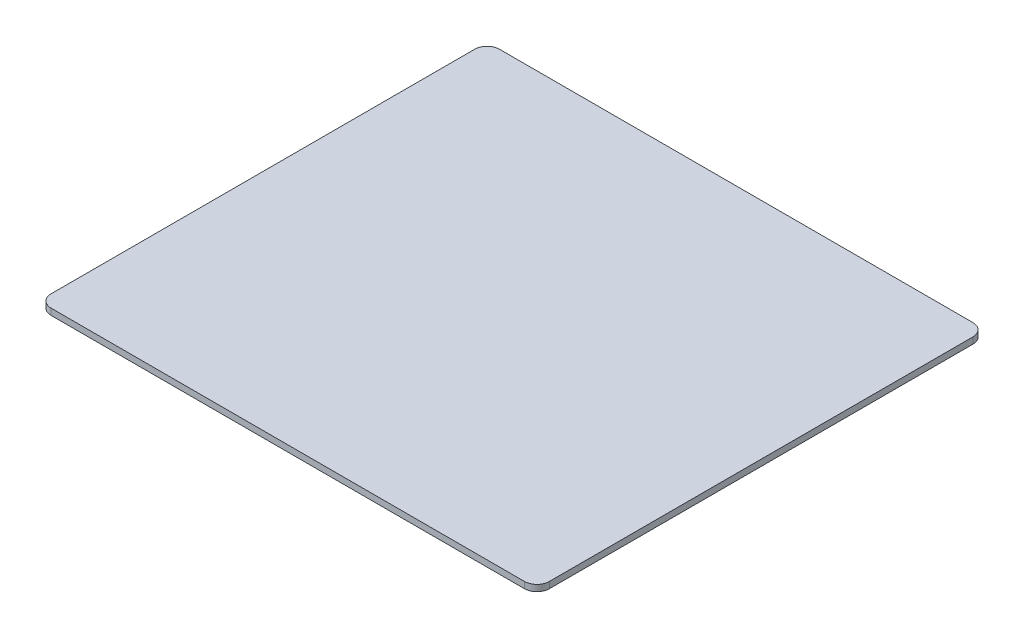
ISO-10303-21;
HEADER;
FILE_DESCRIPTION(('STEP AP214'),'2;1');
FILE_NAME('part.step','',(''),(''),'','','');
FILE_SCHEMA(('AUTOMOTIVE_DESIGN { 1 0 10303 214 1 1 1 1 }'));
ENDSEC;
DATA;
#1=APPLICATION_CONTEXT('core data for automotive mechanical design processes');
#2=APPLICATION_PROTOCOL_DEFINITION('international standard','automotive_design',2000,#1);
#3=PRODUCT_CONTEXT('',#1,'mechanical');
#4=PRODUCT('Part','Part','',(#3));
#5=PRODUCT_RELATED_PRODUCT_CATEGORY('part','',(#4));
#6=PRODUCT_DEFINITION_FORMATION('','',#4);
#7=PRODUCT_DEFINITION_CONTEXT('part definition',#1,'design');
#8=PRODUCT_DEFINITION('design','',#6,#7);
#9=PRODUCT_DEFINITION_SHAPE('','',#8);
#10=(LENGTH_UNIT() NAMED_UNIT(*) SI_UNIT(.MILLI.,.METRE.));
#11=(NAMED_UNIT(*) PLANE_ANGLE_UNIT() SI_UNIT($,.RADIAN.));
#12=(NAMED_UNIT(*) SI_UNIT($,.STERADIAN.) SOLID_ANGLE_UNIT());
#13=UNCERTAINTY_MEASURE_WITH_UNIT(LENGTH_MEASURE(1.E-05),#10,'distance_accuracy_value','');
#14=(GEOMETRIC_REPRESENTATION_CONTEXT(3) GLOBAL_UNCERTAINTY_ASSIGNED_CONTEXT((#13)) GLOBAL_UNIT_ASSIGNED_CONTEXT((#10,
#11,#12)) REPRESENTATION_CONTEXT('',''));
#15=CARTESIAN_POINT('',(0.,0.,0.));
#16=DIRECTION('',(0.,0.,1.));
#17=DIRECTION('',(1.,0.,0.));
#18=AXIS2_PLACEMENT_3D('',#15,#16,#17);
#19=CARTESIAN_POINT('',(-12.2260273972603,0.254,12.8630136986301));
#20=DIRECTION('',(1.,0.,0.));
#21=DIRECTION('',(0.,0.,-1.));
#22=AXIS2_PLACEMENT_3D('',#19,#20,#21);
#23=PLANE('',#22);
#24=DIRECTION('',(0.,0.,1.));
#25=VECTOR('',#24,1.);
#26=CARTESIAN_POINT('',(-12.2260273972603,0.254,12.8630136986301));
#27=LINE('',#26,#25);
#28=CARTESIAN_POINT('',(-12.2260273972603,0.254,-4.63698630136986));
#29=VERTEX_POINT('',#28);
#30=CARTESIAN_POINT('',(-12.2260273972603,0.254,12.3630136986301));
#31=VERTEX_POINT('',#30);
#32=EDGE_CURVE('E127',#29,#31,#27,.T.);
#33=ORIENTED_EDGE('',*,*,#32,.F.);
#34=DIRECTION('',(0.,-1.,0.));
#35=VECTOR('',#34,1.);
#36=CARTESIAN_POINT('',(-12.2260273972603,0.254,-4.63698630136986));
#37=LINE('',#36,#35);
#38=CARTESIAN_POINT('',(-12.2260273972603,0.,-4.63698630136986));
#39=VERTEX_POINT('',#38);
#40=EDGE_CURVE('E11',#29,#39,#37,.T.);
#41=ORIENTED_EDGE('',*,*,#40,.T.);
#42=DIRECTION('',(0.,0.,1.));
#43=VECTOR('',#42,1.);
#44=CARTESIAN_POINT('',(-12.2260273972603,0.,12.8630136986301));
#45=LINE('',#44,#43);
#46=CARTESIAN_POINT('',(-12.2260273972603,0.,12.3630136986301));
#47=VERTEX_POINT('',#46);
#48=EDGE_CURVE('E158',#39,#47,#45,.T.);
#49=ORIENTED_EDGE('',*,*,#48,.T.);
#50=DIRECTION('',(0.,-1.,0.));
#51=VECTOR('',#50,1.);
#52=CARTESIAN_POINT('',(-12.2260273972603,0.254,12.3630136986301));
#53=LINE('',#52,#51);
#54=EDGE_CURVE('E41',#47,#31,#53,.F.);
#55=ORIENTED_EDGE('',*,*,#54,.T.);
#56=EDGE_LOOP('',(#33,#41,#49,#55));
#57=FACE_BOUND('',#56,.T.);
#58=ADVANCED_FACE('F33',(#57),#23,.F.);
#59=CARTESIAN_POINT('',(-12.2260273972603,0.254,12.8630136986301));
#60=DIRECTION('',(0.,0.,-1.));
#61=DIRECTION('',(-1.,0.,0.));
#62=AXIS2_PLACEMENT_3D('',#59,#60,#61);
#63=PLANE('',#62);
#64=DIRECTION('',(1.,0.,0.));
#65=VECTOR('',#64,1.);
#66=CARTESIAN_POINT('',(-12.2260273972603,0.,12.8630136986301));
#67=LINE('',#66,#65);
#68=CARTESIAN_POINT('',(-11.7260273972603,0.,12.8630136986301));
#69=VERTEX_POINT('',#68);
#70=CARTESIAN_POINT('',(7.27397260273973,0.,12.8630136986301));
#71=VERTEX_POINT('',#70);
#72=EDGE_CURVE('E132',#69,#71,#67,.T.);
#73=ORIENTED_EDGE('',*,*,#72,.T.);
#74=DIRECTION('',(0.,-1.,0.));
#75=VECTOR('',#74,1.);
#76=CARTESIAN_POINT('',(7.27397260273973,0.254,12.8630136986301));
#77=LINE('',#76,#75);
#78=CARTESIAN_POINT('',(7.27397260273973,0.254,12.8630136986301));
#79=VERTEX_POINT('',#78);
#80=EDGE_CURVE('E48',#71,#79,#77,.F.);
#81=ORIENTED_EDGE('',*,*,#80,.T.);
#82=DIRECTION('',(1.,0.,0.));
#83=VECTOR('',#82,1.);
#84=CARTESIAN_POINT('',(-12.2260273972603,0.254,12.8630136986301));
#85=LINE('',#84,#83);
#86=CARTESIAN_POINT('',(-11.7260273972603,0.254,12.8630136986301));
#87=VERTEX_POINT('',#86);
#88=EDGE_CURVE('E130',#87,#79,#85,.T.);
#89=ORIENTED_EDGE('',*,*,#88,.F.);
#90=DIRECTION('',(0.,-1.,0.));
#91=VECTOR('',#90,1.);
#92=CARTESIAN_POINT('',(-11.7260273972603,0.254,12.8630136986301));
#93=LINE('',#92,#91);
#94=EDGE_CURVE('E150',#87,#69,#93,.T.);
#95=ORIENTED_EDGE('',*,*,#94,.T.);
#96=EDGE_LOOP('',(#73,#81,#89,#95));
#97=FACE_BOUND('',#96,.T.);
#98=ADVANCED_FACE('F165',(#97),#63,.F.);
#99=CARTESIAN_POINT('',(7.77397260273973,0.254,12.8630136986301));
#100=DIRECTION('',(-1.,0.,0.));
#101=DIRECTION('',(0.,0.,1.));
#102=AXIS2_PLACEMENT_3D('',#99,#100,#101);
#103=PLANE('',#102);
#104=DIRECTION('',(0.,0.,-1.));
#105=VECTOR('',#104,1.);
#106=CARTESIAN_POINT('',(7.77397260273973,0.,12.8630136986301));
#107=LINE('',#106,#105);
#108=CARTESIAN_POINT('',(7.77397260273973,0.,12.3630136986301));
#109=VERTEX_POINT('',#108);
#110=CARTESIAN_POINT('',(7.77397260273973,0.,-4.63698630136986));
#111=VERTEX_POINT('',#110);
#112=EDGE_CURVE('E128',#109,#111,#107,.T.);
#113=ORIENTED_EDGE('',*,*,#112,.T.);
#114=DIRECTION('',(0.,-1.,0.));
#115=VECTOR('',#114,1.);
#116=CARTESIAN_POINT('',(7.77397260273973,0.254,-4.63698630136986));
#117=LINE('',#116,#115);
#118=CARTESIAN_POINT('',(7.77397260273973,0.254,-4.63698630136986));
#119=VERTEX_POINT('',#118);
#120=EDGE_CURVE('E105',#111,#119,#117,.F.);
#121=ORIENTED_EDGE('',*,*,#120,.T.);
#122=DIRECTION('',(0.,0.,-1.));
#123=VECTOR('',#122,1.);
#124=CARTESIAN_POINT('',(7.77397260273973,0.254,12.8630136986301));
#125=LINE('',#124,#123);
#126=CARTESIAN_POINT('',(7.77397260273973,0.254,12.3630136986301));
#127=VERTEX_POINT('',#126);
#128=EDGE_CURVE('E169',#127,#119,#125,.T.);
#129=ORIENTED_EDGE('',*,*,#128,.F.);
#130=DIRECTION('',(0.,-1.,0.));
#131=VECTOR('',#130,1.);
#132=CARTESIAN_POINT('',(7.77397260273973,0.254,12.3630136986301));
#133=LINE('',#132,#131);
#134=EDGE_CURVE('E110',#127,#109,#133,.T.);
#135=ORIENTED_EDGE('',*,*,#134,.T.);
#136=EDGE_LOOP('',(#113,#121,#129,#135));
#137=FACE_BOUND('',#136,.T.);
#138=ADVANCED_FACE('F177',(#137),#103,.F.);
#139=CARTESIAN_POINT('',(-12.2260273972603,0.254,-5.13698630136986));
#140=DIRECTION('',(0.,0.,1.));
#141=DIRECTION('',(1.,0.,0.));
#142=AXIS2_PLACEMENT_3D('',#139,#140,#141);
#143=PLANE('',#142);
#144=DIRECTION('',(-1.,0.,0.));
#145=VECTOR('',#144,1.);
#146=CARTESIAN_POINT('',(-12.2260273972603,0.254,-5.13698630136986));
#147=LINE('',#146,#145);
#148=CARTESIAN_POINT('',(7.27397260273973,0.254,-5.13698630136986));
#149=VERTEX_POINT('',#148);
#150=CARTESIAN_POINT('',(-11.7260273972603,0.254,-5.13698630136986));
#151=VERTEX_POINT('',#150);
#152=EDGE_CURVE('E120',#149,#151,#147,.T.);
#153=ORIENTED_EDGE('',*,*,#152,.F.);
#154=DIRECTION('',(0.,-1.,0.));
#155=VECTOR('',#154,1.);
#156=CARTESIAN_POINT('',(7.27397260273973,0.254,-5.13698630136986));
#157=LINE('',#156,#155);
#158=CARTESIAN_POINT('',(7.27397260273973,0.,-5.13698630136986));
#159=VERTEX_POINT('',#158);
#160=EDGE_CURVE('E104',#149,#159,#157,.T.);
#161=ORIENTED_EDGE('',*,*,#160,.T.);
#162=DIRECTION('',(-1.,0.,0.));
#163=VECTOR('',#162,1.);
#164=CARTESIAN_POINT('',(-12.2260273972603,0.,-5.13698630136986));
#165=LINE('',#164,#163);
#166=CARTESIAN_POINT('',(-11.7260273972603,0.,-5.13698630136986));
#167=VERTEX_POINT('',#166);
#168=EDGE_CURVE('E117',#159,#167,#165,.T.);
#169=ORIENTED_EDGE('',*,*,#168,.T.);
#170=DIRECTION('',(0.,-1.,0.));
#171=VECTOR('',#170,1.);
#172=CARTESIAN_POINT('',(-11.7260273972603,0.254,-5.13698630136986));
#173=LINE('',#172,#171);
#174=EDGE_CURVE('E122',#167,#151,#173,.F.);
#175=ORIENTED_EDGE('',*,*,#174,.T.);
#176=EDGE_LOOP('',(#153,#161,#169,#175));
#177=FACE_BOUND('',#176,.T.);
#178=ADVANCED_FACE('F116',(#177),#143,.F.);
#179=CARTESIAN_POINT('',(0.,0.254,0.));
#180=DIRECTION('',(0.,-1.,0.));
#181=DIRECTION('',(0.,0.,-1.));
#182=AXIS2_PLACEMENT_3D('',#179,#180,#181);
#183=PLANE('',#182);
#184=ORIENTED_EDGE('',*,*,#128,.T.);
#185=CARTESIAN_POINT('',(7.27397260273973,0.254,-4.63698630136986));
#186=DIRECTION('',(0.,-1.,0.));
#187=DIRECTION('',(0.,0.,-1.));
#188=AXIS2_PLACEMENT_3D('',#185,#186,#187);
#189=CIRCLE('',#188,0.5);
#190=EDGE_CURVE('E148',#119,#149,#189,.F.);
#191=ORIENTED_EDGE('',*,*,#190,.T.);
#192=ORIENTED_EDGE('',*,*,#152,.T.);
#193=CARTESIAN_POINT('',(-11.7260273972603,0.254,-4.63698630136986));
#194=DIRECTION('',(0.,-1.,0.));
#195=DIRECTION('',(0.,0.,-1.));
#196=AXIS2_PLACEMENT_3D('',#193,#194,#195);
#197=CIRCLE('',#196,0.5);
#198=EDGE_CURVE('E144',#151,#29,#197,.F.);
#199=ORIENTED_EDGE('',*,*,#198,.T.);
#200=ORIENTED_EDGE('',*,*,#32,.T.);
#201=CARTESIAN_POINT('',(-11.7260273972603,0.254,12.3630136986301));
#202=DIRECTION('',(0.,-1.,0.));
#203=DIRECTION('',(0.,0.,-1.));
#204=AXIS2_PLACEMENT_3D('',#201,#202,#203);
#205=CIRCLE('',#204,0.5);
#206=EDGE_CURVE('E55',#31,#87,#205,.F.);
#207=ORIENTED_EDGE('',*,*,#206,.T.);
#208=ORIENTED_EDGE('',*,*,#88,.T.);
#209=CARTESIAN_POINT('',(7.27397260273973,0.254,12.3630136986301));
#210=DIRECTION('',(0.,-1.,0.));
#211=DIRECTION('',(0.,0.,-1.));
#212=AXIS2_PLACEMENT_3D('',#209,#210,#211);
#213=CIRCLE('',#212,0.5);
#214=EDGE_CURVE('E146',#79,#127,#213,.F.);
#215=ORIENTED_EDGE('',*,*,#214,.T.);
#216=EDGE_LOOP('',(#184,#191,#192,#199,#200,#207,#208,#215));
#217=FACE_BOUND('',#216,.T.);
#218=ADVANCED_FACE('F161',(#217),#183,.F.);
#219=CARTESIAN_POINT('',(0.,0.,0.));
#220=DIRECTION('',(0.,-1.,0.));
#221=DIRECTION('',(0.,0.,-1.));
#222=AXIS2_PLACEMENT_3D('',#219,#220,#221);
#223=PLANE('',#222);
#224=ORIENTED_EDGE('',*,*,#168,.F.);
#225=CARTESIAN_POINT('',(7.27397260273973,0.,-4.63698630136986));
#226=DIRECTION('',(0.,-1.,0.));
#227=DIRECTION('',(0.,0.,-1.));
#228=AXIS2_PLACEMENT_3D('',#225,#226,#227);
#229=CIRCLE('',#228,0.5);
#230=EDGE_CURVE('E100',#159,#111,#229,.T.);
#231=ORIENTED_EDGE('',*,*,#230,.T.);
#232=ORIENTED_EDGE('',*,*,#112,.F.);
#233=CARTESIAN_POINT('',(7.27397260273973,0.,12.3630136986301));
#234=DIRECTION('',(0.,-1.,0.));
#235=DIRECTION('',(0.,0.,-1.));
#236=AXIS2_PLACEMENT_3D('',#233,#234,#235);
#237=CIRCLE('',#236,0.5);
#238=EDGE_CURVE('E111',#109,#71,#237,.T.);
#239=ORIENTED_EDGE('',*,*,#238,.T.);
#240=ORIENTED_EDGE('',*,*,#72,.F.);
#241=CARTESIAN_POINT('',(-11.7260273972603,0.,12.3630136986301));
#242=DIRECTION('',(0.,-1.,0.));
#243=DIRECTION('',(0.,0.,-1.));
#244=AXIS2_PLACEMENT_3D('',#241,#242,#243);
#245=CIRCLE('',#244,0.5);
#246=EDGE_CURVE('E121',#69,#47,#245,.T.);
#247=ORIENTED_EDGE('',*,*,#246,.T.);
#248=ORIENTED_EDGE('',*,*,#48,.F.);
#249=CARTESIAN_POINT('',(-11.7260273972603,0.,-4.63698630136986));
#250=DIRECTION('',(0.,-1.,0.));
#251=DIRECTION('',(0.,0.,-1.));
#252=AXIS2_PLACEMENT_3D('',#249,#250,#251);
#253=CIRCLE('',#252,0.5);
#254=EDGE_CURVE('E126',#39,#167,#253,.T.);
#255=ORIENTED_EDGE('',*,*,#254,.T.);
#256=EDGE_LOOP('',(#224,#231,#232,#239,#240,#247,#248,#255));
#257=FACE_BOUND('',#256,.T.);
#258=ADVANCED_FACE('F124',(#257),#223,.T.);
#259=CARTESIAN_POINT('',(7.27397260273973,0.254,-4.63698630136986));
#260=DIRECTION('',(0.,-1.,0.));
#261=DIRECTION('',(0.,0.,-1.));
#262=AXIS2_PLACEMENT_3D('',#259,#260,#261);
#263=CYLINDRICAL_SURFACE('',#262,0.5);
#264=ORIENTED_EDGE('',*,*,#190,.F.);
#265=ORIENTED_EDGE('',*,*,#120,.F.);
#266=ORIENTED_EDGE('',*,*,#230,.F.);
#267=ORIENTED_EDGE('',*,*,#160,.F.);
#268=EDGE_LOOP('',(#264,#265,#266,#267));
#269=FACE_BOUND('',#268,.T.);
#270=ADVANCED_FACE('F103',(#269),#263,.T.);
#271=CARTESIAN_POINT('',(7.27397260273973,0.254,12.3630136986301));
#272=DIRECTION('',(0.,-1.,0.));
#273=DIRECTION('',(0.,0.,-1.));
#274=AXIS2_PLACEMENT_3D('',#271,#272,#273);
#275=CYLINDRICAL_SURFACE('',#274,0.5);
#276=ORIENTED_EDGE('',*,*,#214,.F.);
#277=ORIENTED_EDGE('',*,*,#80,.F.);
#278=ORIENTED_EDGE('',*,*,#238,.F.);
#279=ORIENTED_EDGE('',*,*,#134,.F.);
#280=EDGE_LOOP('',(#276,#277,#278,#279));
#281=FACE_BOUND('',#280,.T.);
#282=ADVANCED_FACE('F175',(#281),#275,.T.);
#283=CARTESIAN_POINT('',(-11.7260273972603,0.254,-4.63698630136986));
#284=DIRECTION('',(0.,-1.,0.));
#285=DIRECTION('',(0.,0.,-1.));
#286=AXIS2_PLACEMENT_3D('',#283,#284,#285);
#287=CYLINDRICAL_SURFACE('',#286,0.5);
#288=ORIENTED_EDGE('',*,*,#198,.F.);
#289=ORIENTED_EDGE('',*,*,#174,.F.);
#290=ORIENTED_EDGE('',*,*,#254,.F.);
#291=ORIENTED_EDGE('',*,*,#40,.F.);
#292=EDGE_LOOP('',(#288,#289,#290,#291));
#293=FACE_BOUND('',#292,.T.);
#294=ADVANCED_FACE('F179',(#293),#287,.T.);
#295=CARTESIAN_POINT('',(-11.7260273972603,0.254,12.3630136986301));
#296=DIRECTION('',(0.,-1.,0.));
#297=DIRECTION('',(0.,0.,-1.));
#298=AXIS2_PLACEMENT_3D('',#295,#296,#297);
#299=CYLINDRICAL_SURFACE('',#298,0.5);
#300=ORIENTED_EDGE('',*,*,#206,.F.);
#301=ORIENTED_EDGE('',*,*,#54,.F.);
#302=ORIENTED_EDGE('',*,*,#246,.F.);
#303=ORIENTED_EDGE('',*,*,#94,.F.);
#304=EDGE_LOOP('',(#300,#301,#302,#303));
#305=FACE_BOUND('',#304,.T.);
#306=ADVANCED_FACE('F35',(#305),#299,.T.);
#307=CLOSED_SHELL('',(#58,#98,#138,#178,#218,#258,#270,#282,#294,#306));
#308=MANIFOLD_SOLID_BREP('B2',#307);
#309=ADVANCED_BREP_SHAPE_REPRESENTATION('',(#18,#308),#14);
#310=SHAPE_DEFINITION_REPRESENTATION(#9,#309);
ENDSEC;
END-ISO-10303-21;
